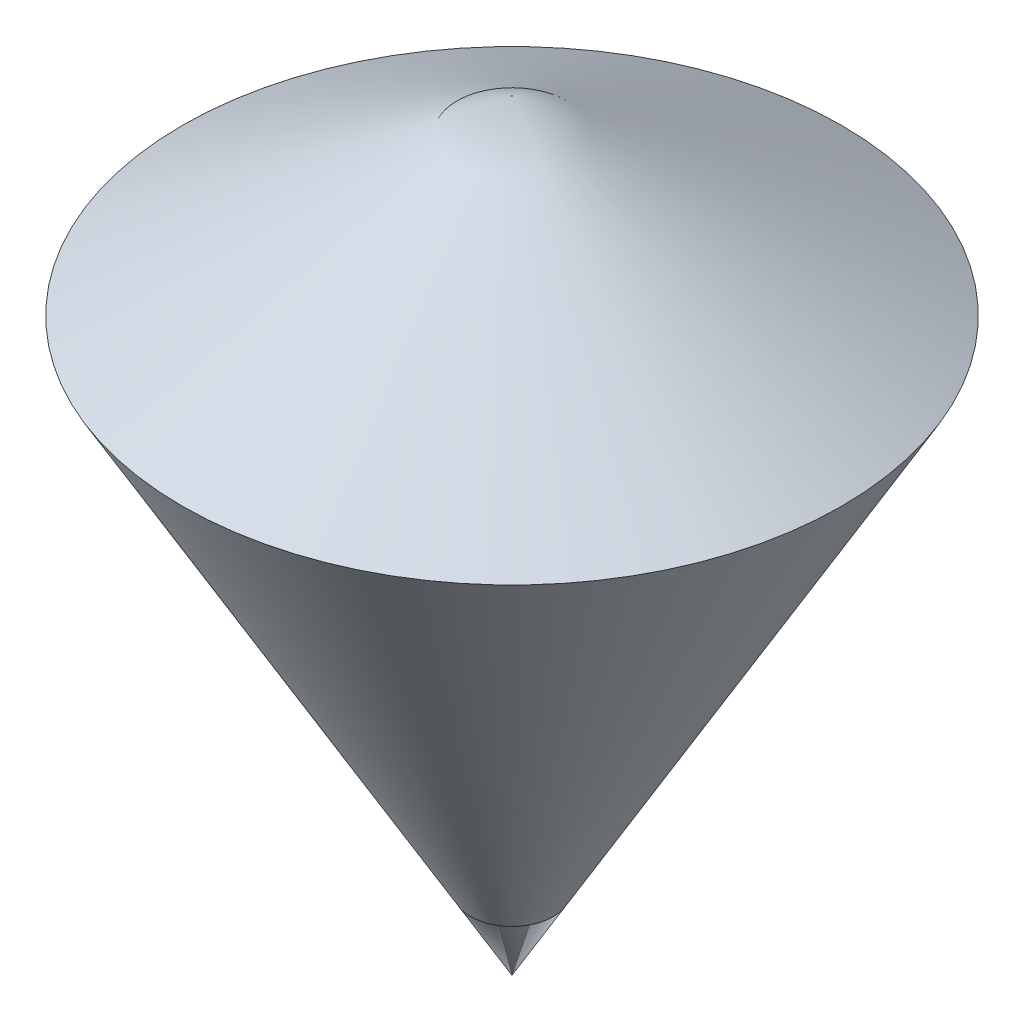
ISO-10303-21;
HEADER;
FILE_DESCRIPTION(('STEP AP214'),'2;1');
FILE_NAME('part.step','',(''),(''),'','','');
FILE_SCHEMA(('AUTOMOTIVE_DESIGN { 1 0 10303 214 1 1 1 1 }'));
ENDSEC;
DATA;
#1=APPLICATION_CONTEXT('core data for automotive mechanical design processes');
#2=APPLICATION_PROTOCOL_DEFINITION('international standard','automotive_design',2000,#1);
#3=PRODUCT_CONTEXT('',#1,'mechanical');
#4=PRODUCT('Part','Part','',(#3));
#5=PRODUCT_RELATED_PRODUCT_CATEGORY('part','',(#4));
#6=PRODUCT_DEFINITION_FORMATION('','',#4);
#7=PRODUCT_DEFINITION_CONTEXT('part definition',#1,'design');
#8=PRODUCT_DEFINITION('design','',#6,#7);
#9=PRODUCT_DEFINITION_SHAPE('','',#8);
#10=(LENGTH_UNIT() NAMED_UNIT(*) SI_UNIT(.MILLI.,.METRE.));
#11=(NAMED_UNIT(*) PLANE_ANGLE_UNIT() SI_UNIT($,.RADIAN.));
#12=(NAMED_UNIT(*) SI_UNIT($,.STERADIAN.) SOLID_ANGLE_UNIT());
#13=UNCERTAINTY_MEASURE_WITH_UNIT(LENGTH_MEASURE(1.E-05),#10,'distance_accuracy_value','');
#14=(GEOMETRIC_REPRESENTATION_CONTEXT(3) GLOBAL_UNCERTAINTY_ASSIGNED_CONTEXT((#13)) GLOBAL_UNIT_ASSIGNED_CONTEXT((#10,
#11,#12)) REPRESENTATION_CONTEXT('',''));
#15=CARTESIAN_POINT('',(0.,0.,0.));
#16=DIRECTION('',(0.,0.,1.));
#17=DIRECTION('',(1.,0.,0.));
#18=AXIS2_PLACEMENT_3D('',#15,#16,#17);
#19=CARTESIAN_POINT('',(0.,40.,0.));
#20=DIRECTION('',(0.,-1.,0.));
#21=DIRECTION('',(1.,0.,0.));
#22=AXIS2_PLACEMENT_3D('',#19,#20,#21);
#23=CONICAL_SURFACE('',#22,0.,1.04719755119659);
#24=CARTESIAN_POINT('',(0.,30.,0.));
#25=DIRECTION('',(0.,1.,0.));
#26=DIRECTION('',(-1.,0.,0.));
#27=AXIS2_PLACEMENT_3D('',#24,#25,#26);
#28=CIRCLE('',#27,17.3205080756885);
#29=CARTESIAN_POINT('',(-17.3205080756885,30.,0.));
#30=VERTEX_POINT('',#29);
#31=EDGE_CURVE('E11',#30,#30,#28,.T.);
#32=ORIENTED_EDGE('',*,*,#31,.T.);
#33=EDGE_LOOP('',(#32));
#34=FACE_BOUND('',#33,.T.);
#35=CARTESIAN_POINT('',(0.,40.,0.));
#36=VERTEX_POINT('',#35);
#37=VERTEX_LOOP('',#36);
#38=FACE_BOUND('',#37,.T.);
#39=ADVANCED_FACE('F33',(#34,#38),#23,.T.);
#40=CARTESIAN_POINT('',(0.,30.,0.));
#41=DIRECTION('',(0.,1.,0.));
#42=DIRECTION('',(-1.,0.,0.));
#43=AXIS2_PLACEMENT_3D('',#40,#41,#42);
#44=CONICAL_SURFACE('',#43,17.3205080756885,0.523598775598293);
#45=CARTESIAN_POINT('',(0.,0.,0.));
#46=VERTEX_POINT('',#45);
#47=VERTEX_LOOP('',#46);
#48=FACE_BOUND('',#47,.T.);
#49=ORIENTED_EDGE('',*,*,#31,.F.);
#50=EDGE_LOOP('',(#49));
#51=FACE_BOUND('',#50,.T.);
#52=ADVANCED_FACE('F45',(#48,#51),#44,.T.);
#53=CLOSED_SHELL('',(#39,#52));
#54=MANIFOLD_SOLID_BREP('B2',#53);
#55=ADVANCED_BREP_SHAPE_REPRESENTATION('',(#18,#54),#14);
#56=SHAPE_DEFINITION_REPRESENTATION(#9,#55);
ENDSEC;
END-ISO-10303-21;
